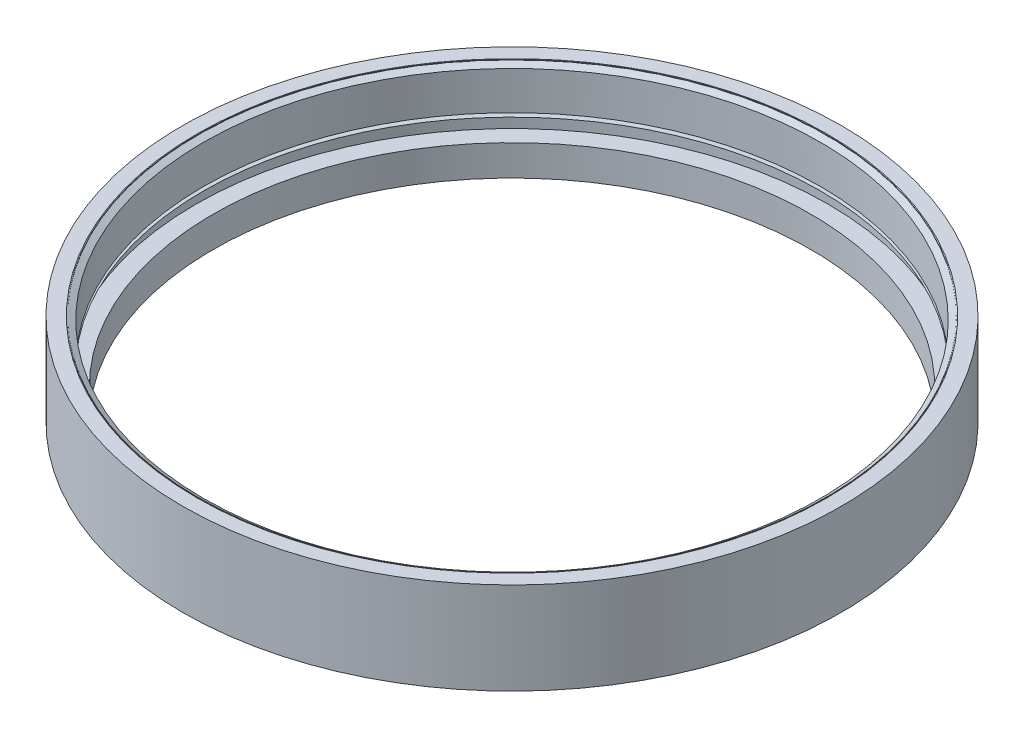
ISO-10303-21;
HEADER;
FILE_DESCRIPTION(('STEP AP214'),'2;1');
FILE_NAME('part.step','',(''),(''),'','','');
FILE_SCHEMA(('AUTOMOTIVE_DESIGN { 1 0 10303 214 1 1 1 1 }'));
ENDSEC;
DATA;
#1=APPLICATION_CONTEXT('core data for automotive mechanical design processes');
#2=APPLICATION_PROTOCOL_DEFINITION('international standard','automotive_design',2000,#1);
#3=PRODUCT_CONTEXT('',#1,'mechanical');
#4=PRODUCT('Part','Part','',(#3));
#5=PRODUCT_RELATED_PRODUCT_CATEGORY('part','',(#4));
#6=PRODUCT_DEFINITION_FORMATION('','',#4);
#7=PRODUCT_DEFINITION_CONTEXT('part definition',#1,'design');
#8=PRODUCT_DEFINITION('design','',#6,#7);
#9=PRODUCT_DEFINITION_SHAPE('','',#8);
#10=(LENGTH_UNIT() NAMED_UNIT(*) SI_UNIT(.MILLI.,.METRE.));
#11=(NAMED_UNIT(*) PLANE_ANGLE_UNIT() SI_UNIT($,.RADIAN.));
#12=(NAMED_UNIT(*) SI_UNIT($,.STERADIAN.) SOLID_ANGLE_UNIT());
#13=UNCERTAINTY_MEASURE_WITH_UNIT(LENGTH_MEASURE(1.E-05),#10,'distance_accuracy_value','');
#14=(GEOMETRIC_REPRESENTATION_CONTEXT(3) GLOBAL_UNCERTAINTY_ASSIGNED_CONTEXT((#13)) GLOBAL_UNIT_ASSIGNED_CONTEXT((#10,
#11,#12)) REPRESENTATION_CONTEXT('',''));
#15=CARTESIAN_POINT('',(0.,0.,0.));
#16=DIRECTION('',(0.,0.,1.));
#17=DIRECTION('',(1.,0.,0.));
#18=AXIS2_PLACEMENT_3D('',#15,#16,#17);
#19=CARTESIAN_POINT('',(0.,6.,0.));
#20=DIRECTION('',(0.,1.,0.));
#21=DIRECTION('',(0.,0.,1.));
#22=AXIS2_PLACEMENT_3D('',#19,#20,#21);
#23=PLANE('',#22);
#24=CARTESIAN_POINT('',(0.,6.00000000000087,0.));
#25=DIRECTION('',(0.,-1.,0.));
#26=DIRECTION('',(0.,0.,-1.));
#27=AXIS2_PLACEMENT_3D('',#24,#25,#26);
#28=CIRCLE('',#27,41.1160254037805);
#29=CARTESIAN_POINT('',(0.,6.00000000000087,-41.1160254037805));
#30=VERTEX_POINT('',#29);
#31=EDGE_CURVE('P0_E152',#30,#30,#28,.F.);
#32=ORIENTED_EDGE('',*,*,#31,.T.);
#33=EDGE_LOOP('',(#32));
#34=FACE_BOUND('',#33,.T.);
#35=CARTESIAN_POINT('',(0.,6.,0.));
#36=DIRECTION('',(0.,1.,0.));
#37=DIRECTION('',(0.,0.,1.));
#38=AXIS2_PLACEMENT_3D('',#35,#36,#37);
#39=CIRCLE('',#38,41.25);
#40=CARTESIAN_POINT('',(0.,6.,41.25));
#41=VERTEX_POINT('',#40);
#42=EDGE_CURVE('P0_E19',#41,#41,#39,.F.);
#43=ORIENTED_EDGE('',*,*,#42,.T.);
#44=EDGE_LOOP('',(#43));
#45=FACE_BOUND('',#44,.T.);
#46=ADVANCED_FACE('P0_F16',(#34,#45),#23,.F.);
#47=CARTESIAN_POINT('',(0.,-0.6,0.));
#48=DIRECTION('',(0.,1.,0.));
#49=DIRECTION('',(0.,0.,1.));
#50=AXIS2_PLACEMENT_3D('',#47,#48,#49);
#51=CYLINDRICAL_SURFACE('',#50,41.25);
#52=CARTESIAN_POINT('',(0.,4.,0.));
#53=DIRECTION('',(0.,1.,0.));
#54=DIRECTION('',(0.,0.,1.));
#55=AXIS2_PLACEMENT_3D('',#52,#53,#54);
#56=CIRCLE('',#55,41.25);
#57=CARTESIAN_POINT('',(0.,4.,41.25));
#58=VERTEX_POINT('',#57);
#59=EDGE_CURVE('P0_E127',#58,#58,#56,.T.);
#60=ORIENTED_EDGE('',*,*,#59,.F.);
#61=EDGE_LOOP('',(#60));
#62=FACE_BOUND('',#61,.T.);
#63=ORIENTED_EDGE('',*,*,#42,.F.);
#64=EDGE_LOOP('',(#63));
#65=FACE_BOUND('',#64,.T.);
#66=ADVANCED_FACE('P0_F160',(#62,#65),#51,.F.);
#67=CARTESIAN_POINT('',(0.,6.00000000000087,0.));
#68=DIRECTION('',(0.,-1.,0.));
#69=DIRECTION('',(0.,0.,-1.));
#70=AXIS2_PLACEMENT_3D('',#67,#68,#69);
#71=CONICAL_SURFACE('',#70,41.1160254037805,1.0471975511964);
#72=ORIENTED_EDGE('',*,*,#31,.F.);
#73=EDGE_LOOP('',(#72));
#74=FACE_BOUND('',#73,.T.);
#75=CARTESIAN_POINT('',(0.,6.5,0.));
#76=DIRECTION('',(0.,1.,0.));
#77=DIRECTION('',(0.,0.,1.));
#78=AXIS2_PLACEMENT_3D('',#75,#76,#77);
#79=CIRCLE('',#78,40.25);
#80=CARTESIAN_POINT('',(0.,6.5,40.25));
#81=VERTEX_POINT('',#80);
#82=EDGE_CURVE('P0_E125',#81,#81,#79,.T.);
#83=ORIENTED_EDGE('',*,*,#82,.T.);
#84=EDGE_LOOP('',(#83));
#85=FACE_BOUND('',#84,.T.);
#86=ADVANCED_FACE('P0_F52',(#74,#85),#71,.F.);
#87=CARTESIAN_POINT('',(0.,4.,0.));
#88=DIRECTION('',(0.,1.,0.));
#89=DIRECTION('',(0.,0.,1.));
#90=AXIS2_PLACEMENT_3D('',#87,#88,#89);
#91=PLANE('',#90);
#92=CARTESIAN_POINT('',(0.,4.,0.));
#93=DIRECTION('',(0.,1.,0.));
#94=DIRECTION('',(0.,0.,1.));
#95=AXIS2_PLACEMENT_3D('',#92,#93,#94);
#96=CIRCLE('',#95,39.);
#97=CARTESIAN_POINT('',(0.,4.,39.));
#98=VERTEX_POINT('',#97);
#99=EDGE_CURVE('P0_E124',#98,#98,#96,.F.);
#100=ORIENTED_EDGE('',*,*,#99,.T.);
#101=EDGE_LOOP('',(#100));
#102=FACE_BOUND('',#101,.T.);
#103=ORIENTED_EDGE('',*,*,#59,.T.);
#104=EDGE_LOOP('',(#103));
#105=FACE_BOUND('',#104,.T.);
#106=ADVANCED_FACE('P0_F41',(#102,#105),#91,.T.);
#107=CARTESIAN_POINT('',(41.,3.00000000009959,0.));
#108=DIRECTION('',(0.,-1.,0.));
#109=DIRECTION('',(0.,0.,-1.));
#110=AXIS2_PLACEMENT_3D('',#107,#108,#109);
#111=CONICAL_SURFACE('',#110,1.09999999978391,1.04719755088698);
#112=CARTESIAN_POINT('',(41.,3.,0.));
#113=DIRECTION('',(0.,-1.,0.));
#114=DIRECTION('',(0.,0.,-1.));
#115=AXIS2_PLACEMENT_3D('',#112,#113,#114);
#116=CIRCLE('',#115,1.1);
#117=CARTESIAN_POINT('',(41.,3.,-1.1));
#118=VERTEX_POINT('',#117);
#119=EDGE_CURVE('P0_E119',#118,#118,#116,.T.);
#120=ORIENTED_EDGE('',*,*,#119,.T.);
#121=EDGE_LOOP('',(#120));
#122=FACE_BOUND('',#121,.T.);
#123=CARTESIAN_POINT('',(40.9999999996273,3.63508529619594,0.));
#124=VERTEX_POINT('',#123);
#125=VERTEX_LOOP('',#124);
#126=FACE_BOUND('',#125,.T.);
#127=ADVANCED_FACE('P0_F38',(#122,#126),#111,.F.);
#128=CARTESIAN_POINT('',(0.,2.99999999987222,-41.));
#129=DIRECTION('',(0.,-1.,0.));
#130=DIRECTION('',(0.,0.,-1.));
#131=AXIS2_PLACEMENT_3D('',#128,#129,#130);
#132=CONICAL_SURFACE('',#131,1.10000000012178,1.04719755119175);
#133=CARTESIAN_POINT('',(0.,3.,-41.));
#134=DIRECTION('',(0.,-1.,0.));
#135=DIRECTION('',(0.,0.,-1.));
#136=AXIS2_PLACEMENT_3D('',#133,#134,#135);
#137=CIRCLE('',#136,1.1);
#138=CARTESIAN_POINT('',(0.,3.,-42.1));
#139=VERTEX_POINT('',#138);
#140=EDGE_CURVE('P0_E113',#139,#139,#137,.T.);
#141=ORIENTED_EDGE('',*,*,#140,.T.);
#142=EDGE_LOOP('',(#141));
#143=FACE_BOUND('',#142,.T.);
#144=CARTESIAN_POINT('',(0.,3.63508529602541,-41.));
#145=VERTEX_POINT('',#144);
#146=VERTEX_LOOP('',#145);
#147=FACE_BOUND('',#146,.T.);
#148=ADVANCED_FACE('P0_F40',(#143,#147),#132,.F.);
#149=CARTESIAN_POINT('',(-41.,3.00000000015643,0.));
#150=DIRECTION('',(0.,-1.,0.));
#151=DIRECTION('',(0.,0.,-1.));
#152=AXIS2_PLACEMENT_3D('',#149,#150,#151);
#153=CONICAL_SURFACE('',#152,1.09999999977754,1.04719755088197);
#154=CARTESIAN_POINT('',(-41.,3.,0.));
#155=DIRECTION('',(0.,-1.,0.));
#156=DIRECTION('',(0.,0.,-1.));
#157=AXIS2_PLACEMENT_3D('',#154,#155,#156);
#158=CIRCLE('',#157,1.1);
#159=CARTESIAN_POINT('',(-41.,3.,-1.1));
#160=VERTEX_POINT('',#159);
#161=EDGE_CURVE('P0_E111',#160,#160,#158,.T.);
#162=ORIENTED_EDGE('',*,*,#161,.T.);
#163=EDGE_LOOP('',(#162));
#164=FACE_BOUND('',#163,.T.);
#165=CARTESIAN_POINT('',(-41.0000000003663,3.63508529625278,0.));
#166=VERTEX_POINT('',#165);
#167=VERTEX_LOOP('',#166);
#168=FACE_BOUND('',#167,.T.);
#169=ADVANCED_FACE('P0_F49',(#164,#168),#153,.F.);
#170=CARTESIAN_POINT('',(0.,2.99999999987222,41.));
#171=DIRECTION('',(0.,-1.,0.));
#172=DIRECTION('',(0.,0.,-1.));
#173=AXIS2_PLACEMENT_3D('',#170,#171,#172);
#174=CONICAL_SURFACE('',#173,1.10000000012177,1.04719755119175);
#175=CARTESIAN_POINT('',(0.,3.,41.));
#176=DIRECTION('',(0.,-1.,0.));
#177=DIRECTION('',(0.,0.,-1.));
#178=AXIS2_PLACEMENT_3D('',#175,#176,#177);
#179=CIRCLE('',#178,1.1);
#180=CARTESIAN_POINT('',(0.,3.,39.9));
#181=VERTEX_POINT('',#180);
#182=EDGE_CURVE('P0_E112',#181,#181,#179,.T.);
#183=ORIENTED_EDGE('',*,*,#182,.T.);
#184=EDGE_LOOP('',(#183));
#185=FACE_BOUND('',#184,.T.);
#186=CARTESIAN_POINT('',(0.,3.63508529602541,41.));
#187=VERTEX_POINT('',#186);
#188=VERTEX_LOOP('',#187);
#189=FACE_BOUND('',#188,.T.);
#190=ADVANCED_FACE('P0_F99',(#185,#189),#174,.F.);
#191=CARTESIAN_POINT('',(0.,-0.6,0.));
#192=DIRECTION('',(0.,1.,0.));
#193=DIRECTION('',(0.,0.,1.));
#194=AXIS2_PLACEMENT_3D('',#191,#192,#193);
#195=CYLINDRICAL_SURFACE('',#194,40.25);
#196=CARTESIAN_POINT('',(0.,11.5000000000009,0.));
#197=DIRECTION('',(0.,1.,0.));
#198=DIRECTION('',(-1.,0.,0.));
#199=AXIS2_PLACEMENT_3D('',#196,#197,#198);
#200=CIRCLE('',#199,40.2499999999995);
#201=CARTESIAN_POINT('',(-40.2499999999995,11.5000000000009,0.));
#202=VERTEX_POINT('',#201);
#203=EDGE_CURVE('P0_E116',#202,#202,#200,.T.);
#204=ORIENTED_EDGE('',*,*,#203,.T.);
#205=EDGE_LOOP('',(#204));
#206=FACE_BOUND('',#205,.T.);
#207=ORIENTED_EDGE('',*,*,#82,.F.);
#208=EDGE_LOOP('',(#207));
#209=FACE_BOUND('',#208,.T.);
#210=ADVANCED_FACE('P0_F95',(#206,#209),#195,.F.);
#211=CARTESIAN_POINT('',(0.,-0.6,0.));
#212=DIRECTION('',(0.,1.,0.));
#213=DIRECTION('',(0.,0.,1.));
#214=AXIS2_PLACEMENT_3D('',#211,#212,#213);
#215=CYLINDRICAL_SURFACE('',#214,39.);
#216=ORIENTED_EDGE('',*,*,#99,.F.);
#217=EDGE_LOOP('',(#216));
#218=FACE_BOUND('',#217,.T.);
#219=CARTESIAN_POINT('',(0.,0.,0.));
#220=DIRECTION('',(0.,1.,0.));
#221=DIRECTION('',(0.,0.,1.));
#222=AXIS2_PLACEMENT_3D('',#219,#220,#221);
#223=CIRCLE('',#222,39.);
#224=CARTESIAN_POINT('',(0.,0.,39.));
#225=VERTEX_POINT('',#224);
#226=EDGE_CURVE('P0_E146',#225,#225,#223,.F.);
#227=ORIENTED_EDGE('',*,*,#226,.T.);
#228=EDGE_LOOP('',(#227));
#229=FACE_BOUND('',#228,.T.);
#230=ADVANCED_FACE('P0_F91',(#218,#229),#215,.F.);
#231=CARTESIAN_POINT('',(41.,3.816839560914,0.));
#232=DIRECTION('',(0.,-1.,0.));
#233=DIRECTION('',(0.,0.,-1.));
#234=AXIS2_PLACEMENT_3D('',#231,#232,#233);
#235=CYLINDRICAL_SURFACE('',#234,1.1);
#236=ORIENTED_EDGE('',*,*,#119,.F.);
#237=EDGE_LOOP('',(#236));
#238=FACE_BOUND('',#237,.T.);
#239=CARTESIAN_POINT('',(41.,0.,0.));
#240=DIRECTION('',(0.,-1.,0.));
#241=DIRECTION('',(0.,0.,-1.));
#242=AXIS2_PLACEMENT_3D('',#239,#240,#241);
#243=CIRCLE('',#242,1.1);
#244=CARTESIAN_POINT('',(41.,0.,-1.1));
#245=VERTEX_POINT('',#244);
#246=EDGE_CURVE('P0_E143',#245,#245,#243,.T.);
#247=ORIENTED_EDGE('',*,*,#246,.T.);
#248=EDGE_LOOP('',(#247));
#249=FACE_BOUND('',#248,.T.);
#250=ADVANCED_FACE('P0_F87',(#238,#249),#235,.F.);
#251=CARTESIAN_POINT('',(0.,3.816839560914,-41.));
#252=DIRECTION('',(0.,-1.,0.));
#253=DIRECTION('',(0.,0.,-1.));
#254=AXIS2_PLACEMENT_3D('',#251,#252,#253);
#255=CYLINDRICAL_SURFACE('',#254,1.1);
#256=ORIENTED_EDGE('',*,*,#140,.F.);
#257=EDGE_LOOP('',(#256));
#258=FACE_BOUND('',#257,.T.);
#259=CARTESIAN_POINT('',(0.,0.,-41.));
#260=DIRECTION('',(0.,-1.,0.));
#261=DIRECTION('',(0.,0.,-1.));
#262=AXIS2_PLACEMENT_3D('',#259,#260,#261);
#263=CIRCLE('',#262,1.1);
#264=CARTESIAN_POINT('',(0.,0.,-42.1));
#265=VERTEX_POINT('',#264);
#266=EDGE_CURVE('P0_E140',#265,#265,#263,.T.);
#267=ORIENTED_EDGE('',*,*,#266,.T.);
#268=EDGE_LOOP('',(#267));
#269=FACE_BOUND('',#268,.T.);
#270=ADVANCED_FACE('P0_F83',(#258,#269),#255,.F.);
#271=CARTESIAN_POINT('',(-41.,3.816839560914,0.));
#272=DIRECTION('',(0.,-1.,0.));
#273=DIRECTION('',(0.,0.,-1.));
#274=AXIS2_PLACEMENT_3D('',#271,#272,#273);
#275=CYLINDRICAL_SURFACE('',#274,1.1);
#276=ORIENTED_EDGE('',*,*,#161,.F.);
#277=EDGE_LOOP('',(#276));
#278=FACE_BOUND('',#277,.T.);
#279=CARTESIAN_POINT('',(-41.,0.,0.));
#280=DIRECTION('',(0.,-1.,0.));
#281=DIRECTION('',(0.,0.,-1.));
#282=AXIS2_PLACEMENT_3D('',#279,#280,#281);
#283=CIRCLE('',#282,1.1);
#284=CARTESIAN_POINT('',(-41.,0.,-1.1));
#285=VERTEX_POINT('',#284);
#286=EDGE_CURVE('P0_E137',#285,#285,#283,.T.);
#287=ORIENTED_EDGE('',*,*,#286,.T.);
#288=EDGE_LOOP('',(#287));
#289=FACE_BOUND('',#288,.T.);
#290=ADVANCED_FACE('P0_F79',(#278,#289),#275,.F.);
#291=CARTESIAN_POINT('',(0.,3.816839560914,41.));
#292=DIRECTION('',(0.,-1.,0.));
#293=DIRECTION('',(0.,0.,-1.));
#294=AXIS2_PLACEMENT_3D('',#291,#292,#293);
#295=CYLINDRICAL_SURFACE('',#294,1.1);
#296=ORIENTED_EDGE('',*,*,#182,.F.);
#297=EDGE_LOOP('',(#296));
#298=FACE_BOUND('',#297,.T.);
#299=CARTESIAN_POINT('',(0.,0.,41.));
#300=DIRECTION('',(0.,-1.,0.));
#301=DIRECTION('',(0.,0.,-1.));
#302=AXIS2_PLACEMENT_3D('',#299,#300,#301);
#303=CIRCLE('',#302,1.1);
#304=CARTESIAN_POINT('',(0.,0.,39.9));
#305=VERTEX_POINT('',#304);
#306=EDGE_CURVE('P0_E134',#305,#305,#303,.T.);
#307=ORIENTED_EDGE('',*,*,#306,.T.);
#308=EDGE_LOOP('',(#307));
#309=FACE_BOUND('',#308,.T.);
#310=ADVANCED_FACE('P0_F75',(#298,#309),#295,.F.);
#311=CARTESIAN_POINT('',(0.,11.9999999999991,0.));
#312=DIRECTION('',(0.,1.,0.));
#313=DIRECTION('',(0.,0.,1.));
#314=AXIS2_PLACEMENT_3D('',#311,#312,#313);
#315=CONICAL_SURFACE('',#314,41.1160254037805,1.0471975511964);
#316=ORIENTED_EDGE('',*,*,#203,.F.);
#317=EDGE_LOOP('',(#316));
#318=FACE_BOUND('',#317,.T.);
#319=CARTESIAN_POINT('',(0.,11.9999999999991,0.));
#320=DIRECTION('',(0.,1.,0.));
#321=DIRECTION('',(0.,0.,1.));
#322=AXIS2_PLACEMENT_3D('',#319,#320,#321);
#323=CIRCLE('',#322,41.1160254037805);
#324=CARTESIAN_POINT('',(0.,11.9999999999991,41.1160254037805));
#325=VERTEX_POINT('',#324);
#326=EDGE_CURVE('P0_E131',#325,#325,#323,.F.);
#327=ORIENTED_EDGE('',*,*,#326,.F.);
#328=EDGE_LOOP('',(#327));
#329=FACE_BOUND('',#328,.T.);
#330=ADVANCED_FACE('P0_F71',(#318,#329),#315,.F.);
#331=CARTESIAN_POINT('',(0.,0.,0.));
#332=DIRECTION('',(0.,1.,0.));
#333=DIRECTION('',(0.,0.,1.));
#334=AXIS2_PLACEMENT_3D('',#331,#332,#333);
#335=PLANE('',#334);
#336=ORIENTED_EDGE('',*,*,#306,.F.);
#337=EDGE_LOOP('',(#336));
#338=FACE_BOUND('',#337,.T.);
#339=ORIENTED_EDGE('',*,*,#286,.F.);
#340=EDGE_LOOP('',(#339));
#341=FACE_BOUND('',#340,.T.);
#342=ORIENTED_EDGE('',*,*,#266,.F.);
#343=EDGE_LOOP('',(#342));
#344=FACE_BOUND('',#343,.T.);
#345=ORIENTED_EDGE('',*,*,#246,.F.);
#346=EDGE_LOOP('',(#345));
#347=FACE_BOUND('',#346,.T.);
#348=ORIENTED_EDGE('',*,*,#226,.F.);
#349=EDGE_LOOP('',(#348));
#350=FACE_BOUND('',#349,.T.);
#351=CARTESIAN_POINT('',(0.,0.,0.));
#352=DIRECTION('',(0.,1.,0.));
#353=DIRECTION('',(0.,0.,1.));
#354=AXIS2_PLACEMENT_3D('',#351,#352,#353);
#355=CIRCLE('',#354,43.);
#356=CARTESIAN_POINT('',(0.,0.,43.));
#357=VERTEX_POINT('',#356);
#358=EDGE_CURVE('P0_E25',#357,#357,#355,.T.);
#359=ORIENTED_EDGE('',*,*,#358,.F.);
#360=EDGE_LOOP('',(#359));
#361=FACE_BOUND('',#360,.T.);
#362=ADVANCED_FACE('P0_F64',(#338,#341,#344,#347,#350,#361),#335,.F.);
#363=CARTESIAN_POINT('',(0.,12.,0.));
#364=DIRECTION('',(0.,1.,0.));
#365=DIRECTION('',(0.,0.,1.));
#366=AXIS2_PLACEMENT_3D('',#363,#364,#365);
#367=PLANE('',#366);
#368=ORIENTED_EDGE('',*,*,#326,.T.);
#369=EDGE_LOOP('',(#368));
#370=FACE_BOUND('',#369,.T.);
#371=CARTESIAN_POINT('',(0.,12.,0.));
#372=DIRECTION('',(0.,1.,0.));
#373=DIRECTION('',(0.,0.,1.));
#374=AXIS2_PLACEMENT_3D('',#371,#372,#373);
#375=CIRCLE('',#374,43.);
#376=CARTESIAN_POINT('',(0.,12.,43.));
#377=VERTEX_POINT('',#376);
#378=EDGE_CURVE('P0_E11',#377,#377,#375,.F.);
#379=ORIENTED_EDGE('',*,*,#378,.F.);
#380=EDGE_LOOP('',(#379));
#381=FACE_BOUND('',#380,.T.);
#382=ADVANCED_FACE('P0_F58',(#370,#381),#367,.T.);
#383=CARTESIAN_POINT('',(0.,-0.6,0.));
#384=DIRECTION('',(0.,1.,0.));
#385=DIRECTION('',(0.,0.,1.));
#386=AXIS2_PLACEMENT_3D('',#383,#384,#385);
#387=CYLINDRICAL_SURFACE('',#386,43.);
#388=ORIENTED_EDGE('',*,*,#378,.T.);
#389=EDGE_LOOP('',(#388));
#390=FACE_BOUND('',#389,.T.);
#391=ORIENTED_EDGE('',*,*,#358,.T.);
#392=EDGE_LOOP('',(#391));
#393=FACE_BOUND('',#392,.T.);
#394=ADVANCED_FACE('P0_F56',(#390,#393),#387,.T.);
#395=CLOSED_SHELL('',(#46,#66,#86,#106,#127,#148,#169,#190,#210,#230,#250,#270,#290,#310,#330,
#362,#382,#394));
#396=MANIFOLD_SOLID_BREP('P0_B1',#395);
#397=CARTESIAN_POINT('',(0.,12.,0.));
#398=DIRECTION('',(0.,1.,0.));
#399=DIRECTION('',(0.,0.,1.));
#400=AXIS2_PLACEMENT_3D('',#397,#398,#399);
#401=CYLINDRICAL_SURFACE('',#400,41.);
#402=CARTESIAN_POINT('',(0.,6.,0.));
#403=DIRECTION('',(0.,1.,0.));
#404=DIRECTION('',(0.,0.,1.));
#405=AXIS2_PLACEMENT_3D('',#402,#403,#404);
#406=CIRCLE('',#405,41.);
#407=CARTESIAN_POINT('',(0.,6.,41.));
#408=VERTEX_POINT('',#407);
#409=EDGE_CURVE('P1_E20',#408,#408,#406,.T.);
#410=ORIENTED_EDGE('',*,*,#409,.T.);
#411=EDGE_LOOP('',(#410));
#412=FACE_BOUND('',#411,.T.);
#413=CARTESIAN_POINT('',(0.,12.,0.));
#414=DIRECTION('',(0.,1.,0.));
#415=DIRECTION('',(0.,0.,1.));
#416=AXIS2_PLACEMENT_3D('',#413,#414,#415);
#417=CIRCLE('',#416,41.);
#418=CARTESIAN_POINT('',(0.,12.,41.));
#419=VERTEX_POINT('',#418);
#420=EDGE_CURVE('P1_E11',#419,#419,#417,.F.);
#421=ORIENTED_EDGE('',*,*,#420,.T.);
#422=EDGE_LOOP('',(#421));
#423=FACE_BOUND('',#422,.T.);
#424=ADVANCED_FACE('P1_F16',(#412,#423),#401,.T.);
#425=CARTESIAN_POINT('',(0.,6.,0.));
#426=DIRECTION('',(0.,1.,0.));
#427=DIRECTION('',(0.,0.,1.));
#428=AXIS2_PLACEMENT_3D('',#425,#426,#427);
#429=PLANE('',#428);
#430=CARTESIAN_POINT('',(40.25,6.,1.737814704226E-13));
#431=CARTESIAN_POINT('',(40.2499026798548,6.,3.69309093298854));
#432=CARTESIAN_POINT('',(39.5780410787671,6.,7.32401285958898));
#433=CARTESIAN_POINT('',(38.8656076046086,6.,11.1741961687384));
#434=CARTESIAN_POINT('',(37.4239791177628,6.,14.8158120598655));
#435=CARTESIAN_POINT('',(35.9222064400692,6.,18.609354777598));
#436=CARTESIAN_POINT('',(33.6890693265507,6.,22.0251925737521));
#437=CARTESIAN_POINT('',(31.4086252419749,6.,25.5133917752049));
#438=CARTESIAN_POINT('',(28.4610479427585,6.,28.4610479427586));
#439=CARTESIAN_POINT('',(25.5142280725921,6.,31.4079466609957));
#440=CARTESIAN_POINT('',(22.0251925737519,6.,33.6890693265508));
#441=CARTESIAN_POINT('',(18.6102918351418,6.,35.9217228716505));
#442=CARTESIAN_POINT('',(14.8158120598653,6.,37.4239791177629));
#443=CARTESIAN_POINT('',(11.1752050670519,6.,38.8653162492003));
#444=CARTESIAN_POINT('',(7.32401285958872,6.,39.5780410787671));
#445=CARTESIAN_POINT('',(3.69336125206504,6.,40.2499513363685));
#446=CARTESIAN_POINT('',(-1.2490009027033E-13,6.,40.25));
#447=CARTESIAN_POINT('',(-3.69230207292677,6.,40.2500486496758));
#448=CARTESIAN_POINT('',(-7.32401285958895,6.,39.5780410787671));
#449=CARTESIAN_POINT('',(-11.1741961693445,6.,38.8656076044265));
#450=CARTESIAN_POINT('',(-14.8158120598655,6.,37.4239791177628));
#451=CARTESIAN_POINT('',(-18.6093547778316,6.,35.9222064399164));
#452=CARTESIAN_POINT('',(-22.0251925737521,6.,33.6890693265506));
#453=CARTESIAN_POINT('',(-25.5133917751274,6.,31.4086252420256));
#454=CARTESIAN_POINT('',(-28.4610479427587,6.,28.4610479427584));
#455=CARTESIAN_POINT('',(-31.4079466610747,6.,25.51422807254));
#456=CARTESIAN_POINT('',(-33.6890693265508,6.,22.0251925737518));
#457=CARTESIAN_POINT('',(-35.9217228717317,6.,18.6102918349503));
#458=CARTESIAN_POINT('',(-37.4239791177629,6.,14.8158120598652));
#459=CARTESIAN_POINT('',(-38.8653162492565,6.,11.1752050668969));
#460=CARTESIAN_POINT('',(-39.5780410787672,6.,7.32401285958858));
#461=CARTESIAN_POINT('',(-40.2499026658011,6.,3.69362424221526));
#462=CARTESIAN_POINT('',(-40.25,6.,-2.582252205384E-13));
#463=B_SPLINE_CURVE_WITH_KNOTS('',2,(#430,#431,#432,#433,#434,#435,#436,#437,#438,#439,#440,
#441,#442,#443,#444,#445,#446,#447,#448,#449,#450,#451,#452,#453,#454,#455,#456,#457,#458,#459,
#460,#461,#462),.UNSPECIFIED.,.F.,.F.,(3,2,2,2,2,2,2,2,2,2,2,2,2,2,2,2,3),(0.,0.0625,0.125,
0.1875,0.25,0.3125,0.375,0.4375,0.5,0.5625,0.625,0.6875,0.75,0.8125,0.875,0.9375,1.),.UNSPECIFIED.);
#464=CARTESIAN_POINT('',(40.25,6.,1.737814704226E-13));
#465=VERTEX_POINT('',#464);
#466=CARTESIAN_POINT('',(-40.25,6.,-2.582252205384E-13));
#467=VERTEX_POINT('',#466);
#468=EDGE_CURVE('P1_E28',#465,#467,#463,.T.);
#469=ORIENTED_EDGE('',*,*,#468,.F.);
#470=CARTESIAN_POINT('',(-40.25,6.,-2.582252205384E-13));
#471=CARTESIAN_POINT('',(-40.2499026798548,6.,-3.6930909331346));
#472=CARTESIAN_POINT('',(-39.5780410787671,6.,-7.32401285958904));
#473=CARTESIAN_POINT('',(-38.8656076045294,6.,-11.1741961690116));
#474=CARTESIAN_POINT('',(-37.4239791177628,6.,-14.8158120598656));
#475=CARTESIAN_POINT('',(-35.9222064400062,6.,-18.6093547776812));
#476=CARTESIAN_POINT('',(-33.6890693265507,6.,-22.0251925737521));
#477=CARTESIAN_POINT('',(-31.4086252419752,6.,-25.5133917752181));
#478=CARTESIAN_POINT('',(-28.4610479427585,6.,-28.4610479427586));
#479=CARTESIAN_POINT('',(-25.5142280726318,6.,-31.4079466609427));
#480=CARTESIAN_POINT('',(-22.0251925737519,6.,-33.6890693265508));
#481=CARTESIAN_POINT('',(-18.6102918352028,6.,-35.9217228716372));
#482=CARTESIAN_POINT('',(-14.8158120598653,6.,-37.4239791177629));
#483=CARTESIAN_POINT('',(-11.1752050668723,6.,-38.865316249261));
#484=CARTESIAN_POINT('',(-7.32401285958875,6.,-39.5780410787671));
#485=CARTESIAN_POINT('',(-3.69336125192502,6.,-40.2499513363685));
#486=CARTESIAN_POINT('',(0.,6.,-40.25));
#487=CARTESIAN_POINT('',(3.69230207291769,6.,-40.2500486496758));
#488=CARTESIAN_POINT('',(7.32401285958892,6.,-39.5780410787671));
#489=CARTESIAN_POINT('',(11.1741961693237,6.,-38.8656076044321));
#490=CARTESIAN_POINT('',(14.8158120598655,6.,-37.4239791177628));
#491=CARTESIAN_POINT('',(18.6093547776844,6.,-35.9222064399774));
#492=CARTESIAN_POINT('',(22.0251925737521,6.,-33.6890693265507));
#493=CARTESIAN_POINT('',(25.5133917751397,6.,-31.4086252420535));
#494=CARTESIAN_POINT('',(28.4610479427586,6.,-28.4610479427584));
#495=CARTESIAN_POINT('',(31.4079466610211,6.,-25.5142280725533));
#496=CARTESIAN_POINT('',(33.6890693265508,6.,-22.0251925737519));
#497=CARTESIAN_POINT('',(35.9217228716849,6.,-18.6102918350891));
#498=CARTESIAN_POINT('',(37.4239791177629,6.,-14.8158120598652));
#499=CARTESIAN_POINT('',(38.8653162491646,6.,-11.1752050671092));
#500=CARTESIAN_POINT('',(39.5780410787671,6.,-7.32401285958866));
#501=CARTESIAN_POINT('',(40.2499026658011,6.,-3.69362424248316));
#502=CARTESIAN_POINT('',(40.25,6.,1.737814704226E-13));
#503=B_SPLINE_CURVE_WITH_KNOTS('',2,(#470,#471,#472,#473,#474,#475,#476,#477,#478,#479,#480,
#481,#482,#483,#484,#485,#486,#487,#488,#489,#490,#491,#492,#493,#494,#495,#496,#497,#498,#499,
#500,#501,#502),.UNSPECIFIED.,.F.,.F.,(3,2,2,2,2,2,2,2,2,2,2,2,2,2,2,2,3),(0.,0.0625,0.125,
0.1875,0.25,0.3125,0.375,0.4375,0.5,0.5625,0.625,0.6875,0.75,0.8125,0.875,0.9375,1.),.UNSPECIFIED.);
#504=EDGE_CURVE('P1_E33',#467,#465,#503,.T.);
#505=ORIENTED_EDGE('',*,*,#504,.F.);
#506=EDGE_LOOP('',(#469,#505));
#507=FACE_BOUND('',#506,.T.);
#508=ORIENTED_EDGE('',*,*,#409,.F.);
#509=EDGE_LOOP('',(#508));
#510=FACE_BOUND('',#509,.T.);
#511=ADVANCED_FACE('P1_F17',(#507,#510),#429,.F.);
#512=OPEN_SHELL('',(#424,#511));
#513=SHELL_BASED_SURFACE_MODEL('P1_B1',(#512));
#514=ADVANCED_BREP_SHAPE_REPRESENTATION('',(#18,#396),#14);
#515=MANIFOLD_SURFACE_SHAPE_REPRESENTATION('',(#18,#513),#14);
#516=SHAPE_REPRESENTATION('',(#18),#14);
#517=SHAPE_DEFINITION_REPRESENTATION(#9,#516);
#518=SHAPE_REPRESENTATION_RELATIONSHIP('','',#516,#514);
#519=SHAPE_REPRESENTATION_RELATIONSHIP('','',#516,#515);
ENDSEC;
END-ISO-10303-21;
